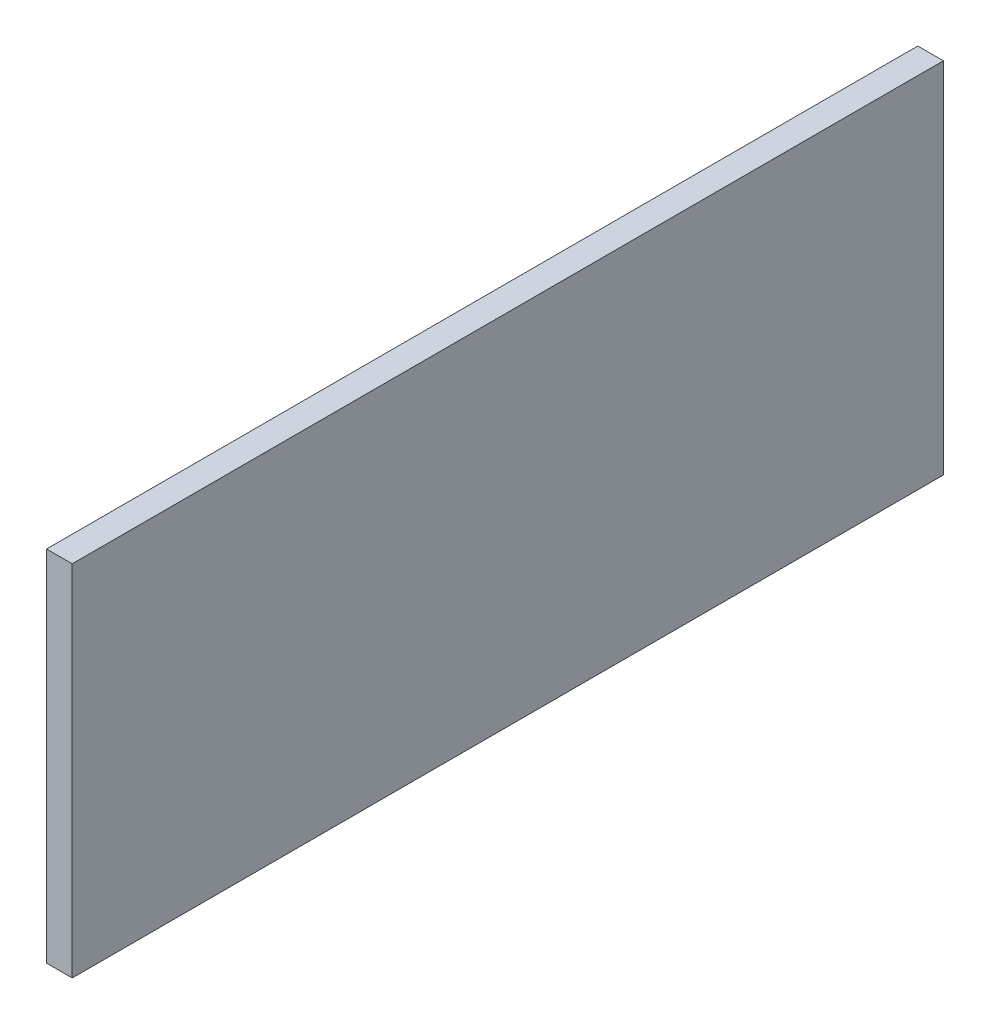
ISO-10303-21;
HEADER;
FILE_DESCRIPTION(('STEP AP214'),'2;1');
FILE_NAME('part.step','',(''),(''),'','','');
FILE_SCHEMA(('AUTOMOTIVE_DESIGN { 1 0 10303 214 1 1 1 1 }'));
ENDSEC;
DATA;
#1=APPLICATION_CONTEXT('core data for automotive mechanical design processes');
#2=APPLICATION_PROTOCOL_DEFINITION('international standard','automotive_design',2000,#1);
#3=PRODUCT_CONTEXT('',#1,'mechanical');
#4=PRODUCT('Part','Part','',(#3));
#5=PRODUCT_RELATED_PRODUCT_CATEGORY('part','',(#4));
#6=PRODUCT_DEFINITION_FORMATION('','',#4);
#7=PRODUCT_DEFINITION_CONTEXT('part definition',#1,'design');
#8=PRODUCT_DEFINITION('design','',#6,#7);
#9=PRODUCT_DEFINITION_SHAPE('','',#8);
#10=(LENGTH_UNIT() NAMED_UNIT(*) SI_UNIT(.MILLI.,.METRE.));
#11=(NAMED_UNIT(*) PLANE_ANGLE_UNIT() SI_UNIT($,.RADIAN.));
#12=(NAMED_UNIT(*) SI_UNIT($,.STERADIAN.) SOLID_ANGLE_UNIT());
#13=UNCERTAINTY_MEASURE_WITH_UNIT(LENGTH_MEASURE(1.E-05),#10,'distance_accuracy_value','');
#14=(GEOMETRIC_REPRESENTATION_CONTEXT(3) GLOBAL_UNCERTAINTY_ASSIGNED_CONTEXT((#13)) GLOBAL_UNIT_ASSIGNED_CONTEXT((#10,
#11,#12)) REPRESENTATION_CONTEXT('',''));
#15=CARTESIAN_POINT('',(0.,0.,0.));
#16=DIRECTION('',(0.,0.,1.));
#17=DIRECTION('',(1.,0.,0.));
#18=AXIS2_PLACEMENT_3D('',#15,#16,#17);
#19=CARTESIAN_POINT('',(0.,355.6,0.));
#20=DIRECTION('',(1.,0.,0.));
#21=DIRECTION('',(0.,0.,-1.));
#22=AXIS2_PLACEMENT_3D('',#19,#20,#21);
#23=PLANE('',#22);
#24=DIRECTION('',(0.,0.,1.));
#25=VECTOR('',#24,1.);
#26=CARTESIAN_POINT('',(0.,0.,0.));
#27=LINE('',#26,#25);
#28=CARTESIAN_POINT('',(0.,0.,-863.6));
#29=VERTEX_POINT('',#28);
#30=CARTESIAN_POINT('',(0.,0.,0.));
#31=VERTEX_POINT('',#30);
#32=EDGE_CURVE('E102',#29,#31,#27,.T.);
#33=ORIENTED_EDGE('',*,*,#32,.T.);
#34=DIRECTION('',(0.,-1.,0.));
#35=VECTOR('',#34,1.);
#36=CARTESIAN_POINT('',(0.,355.6,0.));
#37=LINE('',#36,#35);
#38=CARTESIAN_POINT('',(0.,355.6,0.));
#39=VERTEX_POINT('',#38);
#40=EDGE_CURVE('E11',#39,#31,#37,.T.);
#41=ORIENTED_EDGE('',*,*,#40,.F.);
#42=DIRECTION('',(0.,0.,1.));
#43=VECTOR('',#42,1.);
#44=CARTESIAN_POINT('',(0.,355.6,0.));
#45=LINE('',#44,#43);
#46=CARTESIAN_POINT('',(0.,355.6,-863.6));
#47=VERTEX_POINT('',#46);
#48=EDGE_CURVE('E90',#47,#39,#45,.T.);
#49=ORIENTED_EDGE('',*,*,#48,.F.);
#50=DIRECTION('',(0.,-1.,0.));
#51=VECTOR('',#50,1.);
#52=CARTESIAN_POINT('',(0.,355.6,-863.6));
#53=LINE('',#52,#51);
#54=EDGE_CURVE('E98',#47,#29,#53,.T.);
#55=ORIENTED_EDGE('',*,*,#54,.T.);
#56=EDGE_LOOP('',(#33,#41,#49,#55));
#57=FACE_BOUND('',#56,.T.);
#58=ADVANCED_FACE('F39',(#57),#23,.F.);
#59=CARTESIAN_POINT('',(0.,355.6,0.));
#60=DIRECTION('',(0.,0.,-1.));
#61=DIRECTION('',(-1.,0.,0.));
#62=AXIS2_PLACEMENT_3D('',#59,#60,#61);
#63=PLANE('',#62);
#64=DIRECTION('',(1.,0.,0.));
#65=VECTOR('',#64,1.);
#66=CARTESIAN_POINT('',(0.,0.,0.));
#67=LINE('',#66,#65);
#68=CARTESIAN_POINT('',(25.4,0.,0.));
#69=VERTEX_POINT('',#68);
#70=EDGE_CURVE('E94',#31,#69,#67,.T.);
#71=ORIENTED_EDGE('',*,*,#70,.T.);
#72=DIRECTION('',(0.,-1.,0.));
#73=VECTOR('',#72,1.);
#74=CARTESIAN_POINT('',(25.4,355.6,0.));
#75=LINE('',#74,#73);
#76=CARTESIAN_POINT('',(25.4,355.6,0.));
#77=VERTEX_POINT('',#76);
#78=EDGE_CURVE('E47',#77,#69,#75,.T.);
#79=ORIENTED_EDGE('',*,*,#78,.F.);
#80=DIRECTION('',(1.,0.,0.));
#81=VECTOR('',#80,1.);
#82=CARTESIAN_POINT('',(0.,355.6,0.));
#83=LINE('',#82,#81);
#84=EDGE_CURVE('E85',#39,#77,#83,.T.);
#85=ORIENTED_EDGE('',*,*,#84,.F.);
#86=ORIENTED_EDGE('',*,*,#40,.T.);
#87=EDGE_LOOP('',(#71,#79,#85,#86));
#88=FACE_BOUND('',#87,.T.);
#89=ADVANCED_FACE('F93',(#88),#63,.F.);
#90=CARTESIAN_POINT('',(25.4,355.6,0.));
#91=DIRECTION('',(-1.,0.,0.));
#92=DIRECTION('',(0.,0.,1.));
#93=AXIS2_PLACEMENT_3D('',#90,#91,#92);
#94=PLANE('',#93);
#95=DIRECTION('',(0.,0.,-1.));
#96=VECTOR('',#95,1.);
#97=CARTESIAN_POINT('',(25.4,0.,0.));
#98=LINE('',#97,#96);
#99=CARTESIAN_POINT('',(25.4,0.,-863.6));
#100=VERTEX_POINT('',#99);
#101=EDGE_CURVE('E72',#69,#100,#98,.T.);
#102=ORIENTED_EDGE('',*,*,#101,.T.);
#103=DIRECTION('',(0.,-1.,0.));
#104=VECTOR('',#103,1.);
#105=CARTESIAN_POINT('',(25.4,355.6,-863.6));
#106=LINE('',#105,#104);
#107=CARTESIAN_POINT('',(25.4,355.6,-863.6));
#108=VERTEX_POINT('',#107);
#109=EDGE_CURVE('E95',#108,#100,#106,.T.);
#110=ORIENTED_EDGE('',*,*,#109,.F.);
#111=DIRECTION('',(0.,0.,-1.));
#112=VECTOR('',#111,1.);
#113=CARTESIAN_POINT('',(25.4,355.6,0.));
#114=LINE('',#113,#112);
#115=EDGE_CURVE('E88',#77,#108,#114,.T.);
#116=ORIENTED_EDGE('',*,*,#115,.F.);
#117=ORIENTED_EDGE('',*,*,#78,.T.);
#118=EDGE_LOOP('',(#102,#110,#116,#117));
#119=FACE_BOUND('',#118,.T.);
#120=ADVANCED_FACE('F96',(#119),#94,.F.);
#121=CARTESIAN_POINT('',(0.,355.6,-863.6));
#122=DIRECTION('',(0.,0.,1.));
#123=DIRECTION('',(1.,0.,0.));
#124=AXIS2_PLACEMENT_3D('',#121,#122,#123);
#125=PLANE('',#124);
#126=DIRECTION('',(-1.,0.,0.));
#127=VECTOR('',#126,1.);
#128=CARTESIAN_POINT('',(0.,0.,-863.6));
#129=LINE('',#128,#127);
#130=EDGE_CURVE('E78',#100,#29,#129,.T.);
#131=ORIENTED_EDGE('',*,*,#130,.T.);
#132=ORIENTED_EDGE('',*,*,#54,.F.);
#133=DIRECTION('',(-1.,0.,0.));
#134=VECTOR('',#133,1.);
#135=CARTESIAN_POINT('',(0.,355.6,-863.6));
#136=LINE('',#135,#134);
#137=EDGE_CURVE('E55',#108,#47,#136,.T.);
#138=ORIENTED_EDGE('',*,*,#137,.F.);
#139=ORIENTED_EDGE('',*,*,#109,.T.);
#140=EDGE_LOOP('',(#131,#132,#138,#139));
#141=FACE_BOUND('',#140,.T.);
#142=ADVANCED_FACE('F109',(#141),#125,.F.);
#143=CARTESIAN_POINT('',(0.,355.6,0.));
#144=DIRECTION('',(0.,-1.,0.));
#145=DIRECTION('',(0.,0.,-1.));
#146=AXIS2_PLACEMENT_3D('',#143,#144,#145);
#147=PLANE('',#146);
#148=ORIENTED_EDGE('',*,*,#48,.T.);
#149=ORIENTED_EDGE('',*,*,#84,.T.);
#150=ORIENTED_EDGE('',*,*,#115,.T.);
#151=ORIENTED_EDGE('',*,*,#137,.T.);
#152=EDGE_LOOP('',(#148,#149,#150,#151));
#153=FACE_BOUND('',#152,.T.);
#154=ADVANCED_FACE('F86',(#153),#147,.F.);
#155=CARTESIAN_POINT('',(0.,0.,0.));
#156=DIRECTION('',(0.,-1.,0.));
#157=DIRECTION('',(0.,0.,-1.));
#158=AXIS2_PLACEMENT_3D('',#155,#156,#157);
#159=PLANE('',#158);
#160=ORIENTED_EDGE('',*,*,#32,.F.);
#161=ORIENTED_EDGE('',*,*,#130,.F.);
#162=ORIENTED_EDGE('',*,*,#101,.F.);
#163=ORIENTED_EDGE('',*,*,#70,.F.);
#164=EDGE_LOOP('',(#160,#161,#162,#163));
#165=FACE_BOUND('',#164,.T.);
#166=ADVANCED_FACE('F112',(#165),#159,.T.);
#167=CLOSED_SHELL('',(#58,#89,#120,#142,#154,#166));
#168=MANIFOLD_SOLID_BREP('B2',#167);
#169=ADVANCED_BREP_SHAPE_REPRESENTATION('',(#18,#168),#14);
#170=SHAPE_DEFINITION_REPRESENTATION(#9,#169);
ENDSEC;
END-ISO-10303-21;
